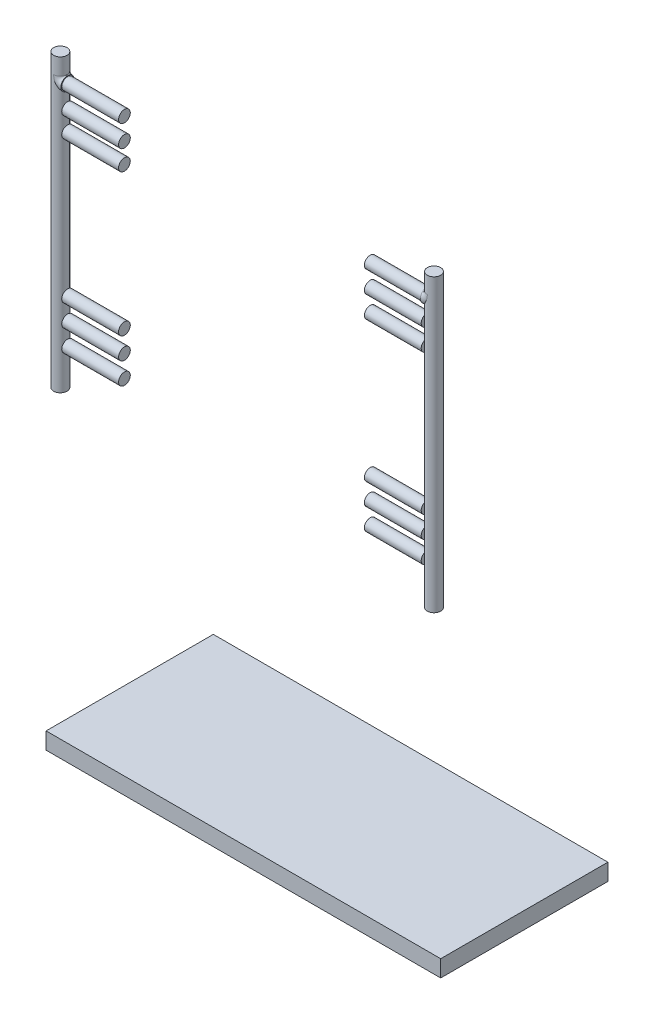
ISO-10303-21;
HEADER;
FILE_DESCRIPTION(('STEP AP214'),'2;1');
FILE_NAME('part.step','',(''),(''),'','','');
FILE_SCHEMA(('AUTOMOTIVE_DESIGN { 1 0 10303 214 1 1 1 1 }'));
ENDSEC;
DATA;
#1=APPLICATION_CONTEXT('core data for automotive mechanical design processes');
#2=APPLICATION_PROTOCOL_DEFINITION('international standard','automotive_design',2000,#1);
#3=PRODUCT_CONTEXT('',#1,'mechanical');
#4=PRODUCT('Part','Part','',(#3));
#5=PRODUCT_RELATED_PRODUCT_CATEGORY('part','',(#4));
#6=PRODUCT_DEFINITION_FORMATION('','',#4);
#7=PRODUCT_DEFINITION_CONTEXT('part definition',#1,'design');
#8=PRODUCT_DEFINITION('design','',#6,#7);
#9=PRODUCT_DEFINITION_SHAPE('','',#8);
#10=(LENGTH_UNIT() NAMED_UNIT(*) SI_UNIT(.MILLI.,.METRE.));
#11=(NAMED_UNIT(*) PLANE_ANGLE_UNIT() SI_UNIT($,.RADIAN.));
#12=(NAMED_UNIT(*) SI_UNIT($,.STERADIAN.) SOLID_ANGLE_UNIT());
#13=UNCERTAINTY_MEASURE_WITH_UNIT(LENGTH_MEASURE(1.E-05),#10,'distance_accuracy_value','');
#14=(GEOMETRIC_REPRESENTATION_CONTEXT(3) GLOBAL_UNCERTAINTY_ASSIGNED_CONTEXT((#13)) GLOBAL_UNIT_ASSIGNED_CONTEXT((#10,
#11,#12)) REPRESENTATION_CONTEXT('',''));
#15=CARTESIAN_POINT('',(0.,0.,0.));
#16=DIRECTION('',(0.,0.,1.));
#17=DIRECTION('',(1.,0.,0.));
#18=AXIS2_PLACEMENT_3D('',#15,#16,#17);
#19=CARTESIAN_POINT('',(945.777768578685,-1629.22223142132,0.));
#20=DIRECTION('',(-1.,0.,0.));
#21=DIRECTION('',(0.,-1.,0.));
#22=AXIS2_PLACEMENT_3D('',#19,#20,#21);
#23=PLANE('',#22);
#24=DIRECTION('',(0.,0.,1.));
#25=VECTOR('',#24,1.);
#26=CARTESIAN_POINT('',(945.777768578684,-1579.22223142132,0.));
#27=LINE('',#26,#25);
#28=CARTESIAN_POINT('',(945.777768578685,-1579.22223142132,-500.));
#29=VERTEX_POINT('',#28);
#30=CARTESIAN_POINT('',(945.777768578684,-1579.22223142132,0.));
#31=VERTEX_POINT('',#30);
#32=EDGE_CURVE('E107',#29,#31,#27,.T.);
#33=ORIENTED_EDGE('',*,*,#32,.T.);
#34=DIRECTION('',(0.,1.,0.));
#35=VECTOR('',#34,1.);
#36=CARTESIAN_POINT('',(945.777768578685,-1629.22223142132,0.));
#37=LINE('',#36,#35);
#38=CARTESIAN_POINT('',(945.777768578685,-1629.22223142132,0.));
#39=VERTEX_POINT('',#38);
#40=EDGE_CURVE('E12',#39,#31,#37,.T.);
#41=ORIENTED_EDGE('',*,*,#40,.F.);
#42=DIRECTION('',(0.,0.,1.));
#43=VECTOR('',#42,1.);
#44=CARTESIAN_POINT('',(945.777768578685,-1629.22223142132,0.));
#45=LINE('',#44,#43);
#46=CARTESIAN_POINT('',(945.777768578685,-1629.22223142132,-500.));
#47=VERTEX_POINT('',#46);
#48=EDGE_CURVE('E95',#47,#39,#45,.T.);
#49=ORIENTED_EDGE('',*,*,#48,.F.);
#50=DIRECTION('',(0.,1.,0.));
#51=VECTOR('',#50,1.);
#52=CARTESIAN_POINT('',(945.777768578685,-1629.22223142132,-500.));
#53=LINE('',#52,#51);
#54=EDGE_CURVE('E103',#47,#29,#53,.T.);
#55=ORIENTED_EDGE('',*,*,#54,.T.);
#56=EDGE_LOOP('',(#33,#41,#49,#55));
#57=FACE_BOUND('',#56,.T.);
#58=ADVANCED_FACE('F44',(#57),#23,.F.);
#59=CARTESIAN_POINT('',(945.777768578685,-1629.22223142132,0.));
#60=DIRECTION('',(0.,0.,-1.));
#61=DIRECTION('',(-1.,0.,0.));
#62=AXIS2_PLACEMENT_3D('',#59,#60,#61);
#63=PLANE('',#62);
#64=DIRECTION('',(-1.,0.,0.));
#65=VECTOR('',#64,1.);
#66=CARTESIAN_POINT('',(945.777768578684,-1579.22223142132,0.));
#67=LINE('',#66,#65);
#68=CARTESIAN_POINT('',(-234.222231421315,-1579.22223142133,-1.43226500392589E-13));
#69=VERTEX_POINT('',#68);
#70=EDGE_CURVE('E99',#31,#69,#67,.T.);
#71=ORIENTED_EDGE('',*,*,#70,.T.);
#72=DIRECTION('',(0.,1.,0.));
#73=VECTOR('',#72,1.);
#74=CARTESIAN_POINT('',(-234.222231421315,-1629.22223142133,-1.43226500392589E-13));
#75=LINE('',#74,#73);
#76=CARTESIAN_POINT('',(-234.222231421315,-1629.22223142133,-1.43226500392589E-13));
#77=VERTEX_POINT('',#76);
#78=EDGE_CURVE('E52',#77,#69,#75,.T.);
#79=ORIENTED_EDGE('',*,*,#78,.F.);
#80=DIRECTION('',(-1.,0.,0.));
#81=VECTOR('',#80,1.);
#82=CARTESIAN_POINT('',(945.777768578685,-1629.22223142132,0.));
#83=LINE('',#82,#81);
#84=EDGE_CURVE('E90',#39,#77,#83,.T.);
#85=ORIENTED_EDGE('',*,*,#84,.F.);
#86=ORIENTED_EDGE('',*,*,#40,.T.);
#87=EDGE_LOOP('',(#71,#79,#85,#86));
#88=FACE_BOUND('',#87,.T.);
#89=ADVANCED_FACE('F98',(#88),#63,.F.);
#90=CARTESIAN_POINT('',(-234.222231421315,-1629.22223142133,-1.43226500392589E-13));
#91=DIRECTION('',(1.,0.,0.));
#92=DIRECTION('',(0.,1.,0.));
#93=AXIS2_PLACEMENT_3D('',#90,#91,#92);
#94=PLANE('',#93);
#95=DIRECTION('',(0.,0.,-1.));
#96=VECTOR('',#95,1.);
#97=CARTESIAN_POINT('',(-234.222231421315,-1579.22223142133,-1.43226500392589E-13));
#98=LINE('',#97,#96);
#99=CARTESIAN_POINT('',(-234.222231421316,-1579.22223142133,-500.));
#100=VERTEX_POINT('',#99);
#101=EDGE_CURVE('E77',#69,#100,#98,.T.);
#102=ORIENTED_EDGE('',*,*,#101,.T.);
#103=DIRECTION('',(0.,1.,0.));
#104=VECTOR('',#103,1.);
#105=CARTESIAN_POINT('',(-234.222231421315,-1629.22223142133,-500.));
#106=LINE('',#105,#104);
#107=CARTESIAN_POINT('',(-234.222231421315,-1629.22223142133,-500.));
#108=VERTEX_POINT('',#107);
#109=EDGE_CURVE('E100',#108,#100,#106,.T.);
#110=ORIENTED_EDGE('',*,*,#109,.F.);
#111=DIRECTION('',(0.,0.,-1.));
#112=VECTOR('',#111,1.);
#113=CARTESIAN_POINT('',(-234.222231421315,-1629.22223142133,-1.43226500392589E-13));
#114=LINE('',#113,#112);
#115=EDGE_CURVE('E93',#77,#108,#114,.T.);
#116=ORIENTED_EDGE('',*,*,#115,.F.);
#117=ORIENTED_EDGE('',*,*,#78,.T.);
#118=EDGE_LOOP('',(#102,#110,#116,#117));
#119=FACE_BOUND('',#118,.T.);
#120=ADVANCED_FACE('F101',(#119),#94,.F.);
#121=CARTESIAN_POINT('',(945.777768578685,-1629.22223142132,-500.));
#122=DIRECTION('',(0.,0.,1.));
#123=DIRECTION('',(1.,0.,0.));
#124=AXIS2_PLACEMENT_3D('',#121,#122,#123);
#125=PLANE('',#124);
#126=DIRECTION('',(1.,0.,0.));
#127=VECTOR('',#126,1.);
#128=CARTESIAN_POINT('',(945.777768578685,-1579.22223142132,-500.));
#129=LINE('',#128,#127);
#130=EDGE_CURVE('E83',#100,#29,#129,.T.);
#131=ORIENTED_EDGE('',*,*,#130,.T.);
#132=ORIENTED_EDGE('',*,*,#54,.F.);
#133=DIRECTION('',(1.,0.,0.));
#134=VECTOR('',#133,1.);
#135=CARTESIAN_POINT('',(945.777768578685,-1629.22223142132,-500.));
#136=LINE('',#135,#134);
#137=EDGE_CURVE('E60',#108,#47,#136,.T.);
#138=ORIENTED_EDGE('',*,*,#137,.F.);
#139=ORIENTED_EDGE('',*,*,#109,.T.);
#140=EDGE_LOOP('',(#131,#132,#138,#139));
#141=FACE_BOUND('',#140,.T.);
#142=ADVANCED_FACE('F114',(#141),#125,.F.);
#143=CARTESIAN_POINT('',(5.68142099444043E-12,-1629.22223142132,0.));
#144=DIRECTION('',(0.,1.,0.));
#145=DIRECTION('',(-1.,0.,0.));
#146=AXIS2_PLACEMENT_3D('',#143,#144,#145);
#147=PLANE('',#146);
#148=ORIENTED_EDGE('',*,*,#48,.T.);
#149=ORIENTED_EDGE('',*,*,#84,.T.);
#150=ORIENTED_EDGE('',*,*,#115,.T.);
#151=ORIENTED_EDGE('',*,*,#137,.T.);
#152=EDGE_LOOP('',(#148,#149,#150,#151));
#153=FACE_BOUND('',#152,.T.);
#154=ADVANCED_FACE('F91',(#153),#147,.F.);
#155=CARTESIAN_POINT('',(5.50684692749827E-12,-1579.22223142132,0.));
#156=DIRECTION('',(0.,1.,0.));
#157=DIRECTION('',(-1.,0.,0.));
#158=AXIS2_PLACEMENT_3D('',#155,#156,#157);
#159=PLANE('',#158);
#160=ORIENTED_EDGE('',*,*,#32,.F.);
#161=ORIENTED_EDGE('',*,*,#130,.F.);
#162=ORIENTED_EDGE('',*,*,#101,.F.);
#163=ORIENTED_EDGE('',*,*,#70,.F.);
#164=EDGE_LOOP('',(#160,#161,#162,#163));
#165=FACE_BOUND('',#164,.T.);
#166=ADVANCED_FACE('F117',(#165),#159,.T.);
#167=CLOSED_SHELL('',(#58,#89,#120,#142,#154,#166));
#168=MANIFOLD_SOLID_BREP('B2',#167);
#169=CARTESIAN_POINT('',(905.,120.,0.));
#170=DIRECTION('',(-1.,0.,0.));
#171=DIRECTION('',(0.,0.,1.));
#172=AXIS2_PLACEMENT_3D('',#169,#170,#171);
#173=CYLINDRICAL_SURFACE('',#172,17.5);
#174=CARTESIAN_POINT('',(905.,120.,0.));
#175=DIRECTION('',(1.,0.,0.));
#176=DIRECTION('',(0.,0.,-1.));
#177=AXIS2_PLACEMENT_3D('',#174,#175,#176);
#178=CIRCLE('',#177,17.5);
#179=CARTESIAN_POINT('',(905.,120.,-17.5));
#180=VERTEX_POINT('',#179);
#181=EDGE_CURVE('E42',#180,#180,#178,.T.);
#182=ORIENTED_EDGE('',*,*,#181,.F.);
#183=EDGE_LOOP('',(#182));
#184=FACE_BOUND('',#183,.T.);
#185=CARTESIAN_POINT('',(735.,120.,0.));
#186=DIRECTION('',(1.,0.,0.));
#187=DIRECTION('',(0.,0.,-1.));
#188=AXIS2_PLACEMENT_3D('',#185,#186,#187);
#189=CIRCLE('',#188,17.5);
#190=CARTESIAN_POINT('',(735.,120.,-17.5));
#191=VERTEX_POINT('',#190);
#192=EDGE_CURVE('E178',#191,#191,#189,.T.);
#193=ORIENTED_EDGE('',*,*,#192,.T.);
#194=EDGE_LOOP('',(#193));
#195=FACE_BOUND('',#194,.T.);
#196=ADVANCED_FACE('F175',(#184,#195),#173,.T.);
#197=CARTESIAN_POINT('',(735.,120.,0.));
#198=DIRECTION('',(1.,0.,0.));
#199=DIRECTION('',(0.,0.,-1.));
#200=AXIS2_PLACEMENT_3D('',#197,#198,#199);
#201=PLANE('',#200);
#202=ORIENTED_EDGE('',*,*,#192,.F.);
#203=EDGE_LOOP('',(#202));
#204=FACE_BOUND('',#203,.T.);
#205=ADVANCED_FACE('F220',(#204),#201,.F.);
#206=CARTESIAN_POINT('',(905.,120.,0.));
#207=DIRECTION('',(1.,0.,0.));
#208=DIRECTION('',(0.,0.,-1.));
#209=AXIS2_PLACEMENT_3D('',#206,#207,#208);
#210=PLANE('',#209);
#211=CARTESIAN_POINT('',(905.,120.,0.));
#212=DIRECTION('',(1.,0.,0.));
#213=DIRECTION('',(0.,0.,-1.));
#214=AXIS2_PLACEMENT_3D('',#211,#212,#213);
#215=CIRCLE('',#214,20.);
#216=CARTESIAN_POINT('',(905.,120.,-20.));
#217=VERTEX_POINT('',#216);
#218=EDGE_CURVE('E194',#217,#217,#215,.T.);
#219=ORIENTED_EDGE('',*,*,#218,.F.);
#220=EDGE_LOOP('',(#219));
#221=FACE_BOUND('',#220,.T.);
#222=ORIENTED_EDGE('',*,*,#181,.T.);
#223=EDGE_LOOP('',(#222));
#224=FACE_BOUND('',#223,.T.);
#225=ADVANCED_FACE('F218',(#221,#224),#210,.F.);
#226=CARTESIAN_POINT('',(905.,140.777768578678,0.));
#227=DIRECTION('',(0.,0.,-1.));
#228=DIRECTION('',(-1.,0.,0.));
#229=AXIS2_PLACEMENT_3D('',#226,#227,#228);
#230=TOROIDAL_SURFACE('',#229,20.7777685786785,20.);
#231=CARTESIAN_POINT('',(925.777768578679,140.777768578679,0.));
#232=DIRECTION('',(0.,1.,0.));
#233=DIRECTION('',(0.,0.,-1.));
#234=AXIS2_PLACEMENT_3D('',#231,#232,#233);
#235=CIRCLE('',#234,20.);
#236=CARTESIAN_POINT('',(925.777768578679,140.777768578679,-20.));
#237=VERTEX_POINT('',#236);
#238=CARTESIAN_POINT('',(925.777768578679,140.777768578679,20.));
#239=VERTEX_POINT('',#238);
#240=EDGE_CURVE('E188',#237,#239,#235,.T.);
#241=ORIENTED_EDGE('',*,*,#240,.F.);
#242=CARTESIAN_POINT('',(925.777768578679,140.777768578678,-20.));
#243=CARTESIAN_POINT('',(925.777768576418,140.709817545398,-20.0000000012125));
#244=CARTESIAN_POINT('',(925.777601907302,140.641866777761,-20.0000000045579));
#245=CARTESIAN_POINT('',(925.776965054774,140.512042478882,-19.9999999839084));
#246=CARTESIAN_POINT('',(925.776523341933,140.450168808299,-19.9999999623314));
#247=CARTESIAN_POINT('',(925.773623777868,140.140796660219,-19.9999997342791));
#248=CARTESIAN_POINT('',(925.769093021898,139.893314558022,-19.9999991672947));
#249=CARTESIAN_POINT('',(925.754061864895,139.341469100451,-19.9999877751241));
#250=CARTESIAN_POINT('',(925.742426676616,139.037136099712,-19.9999746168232));
#251=CARTESIAN_POINT('',(925.714593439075,138.471484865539,-19.9999041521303));
#252=CARTESIAN_POINT('',(925.699264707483,138.210122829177,-19.9998532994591));
#253=CARTESIAN_POINT('',(925.645896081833,137.42616187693,-19.9995979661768));
#254=CARTESIAN_POINT('',(925.600484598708,136.904044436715,-19.9992906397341));
#255=CARTESIAN_POINT('',(925.490253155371,135.861728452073,-19.9980087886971));
#256=CARTESIAN_POINT('',(925.425427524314,135.341530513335,-19.9970340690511));
#257=CARTESIAN_POINT('',(925.275910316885,134.29818200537,-19.9938441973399));
#258=CARTESIAN_POINT('',(925.191009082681,133.775061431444,-19.9916155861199));
#259=CARTESIAN_POINT('',(925.002202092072,132.73226147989,-19.9851785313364));
#260=CARTESIAN_POINT('',(924.898294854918,132.212582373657,-19.9809699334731));
#261=CARTESIAN_POINT('',(924.558764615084,130.659247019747,-19.9641129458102));
#262=CARTESIAN_POINT('',(924.29537327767,129.63157017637,-19.9472333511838));
#263=CARTESIAN_POINT('',(923.69915291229,127.59458345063,-19.8939413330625));
#264=CARTESIAN_POINT('',(923.366160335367,126.585323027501,-19.8574825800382));
#265=CARTESIAN_POINT('',(922.637334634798,124.591399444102,-19.7553288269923));
#266=CARTESIAN_POINT('',(922.241509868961,123.606733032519,-19.6896377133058));
#267=CARTESIAN_POINT('',(921.393454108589,121.664169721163,-19.5183273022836));
#268=CARTESIAN_POINT('',(920.941158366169,120.706305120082,-19.4126618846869));
#269=CARTESIAN_POINT('',(919.988229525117,118.821843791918,-19.1500785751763));
#270=CARTESIAN_POINT('',(919.487588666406,117.895252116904,-18.9931524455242));
#271=CARTESIAN_POINT('',(918.447851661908,116.079177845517,-18.6165931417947));
#272=CARTESIAN_POINT('',(917.908826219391,115.189631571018,-18.397073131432));
#273=CARTESIAN_POINT('',(916.801949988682,113.451140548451,-17.8831422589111));
#274=CARTESIAN_POINT('',(916.234112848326,112.602176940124,-17.5887665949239));
#275=CARTESIAN_POINT('',(915.279745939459,111.234641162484,-17.0289126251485));
#276=CARTESIAN_POINT('',(914.897847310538,110.702641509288,-16.7881672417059));
#277=CARTESIAN_POINT('',(914.131113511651,109.661262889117,-16.265627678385));
#278=CARTESIAN_POINT('',(913.746278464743,109.15188298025,-15.9838352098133));
#279=CARTESIAN_POINT('',(912.978767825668,108.158984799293,-15.3761189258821));
#280=CARTESIAN_POINT('',(912.59609098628,107.675449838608,-15.0502240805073));
#281=CARTESIAN_POINT('',(911.838291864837,106.737429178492,-14.3511872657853));
#282=CARTESIAN_POINT('',(911.463167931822,106.282937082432,-13.9780557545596));
#283=CARTESIAN_POINT('',(910.804488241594,105.499375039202,-13.2658984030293));
#284=CARTESIAN_POINT('',(910.518274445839,105.164037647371,-12.9362180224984));
#285=CARTESIAN_POINT('',(909.958251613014,104.516469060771,-12.2450263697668));
#286=CARTESIAN_POINT('',(909.684442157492,104.204237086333,-11.8835161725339));
#287=CARTESIAN_POINT('',(909.153545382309,103.605917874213,-11.1286968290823));
#288=CARTESIAN_POINT('',(908.896441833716,103.319805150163,-10.735419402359));
#289=CARTESIAN_POINT('',(908.40309429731,102.776431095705,-9.91709603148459));
#290=CARTESIAN_POINT('',(908.166845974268,102.519163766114,-9.49205672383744));
#291=CARTESIAN_POINT('',(907.763422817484,102.083720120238,-8.69721141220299));
#292=CARTESIAN_POINT('',(907.591756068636,101.899898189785,-8.33276858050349));
#293=CARTESIAN_POINT('',(907.267491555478,101.554831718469,-7.58521918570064));
#294=CARTESIAN_POINT('',(907.11488986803,101.393582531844,-7.20211648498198));
#295=CARTESIAN_POINT('',(906.831239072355,101.095421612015,-6.41891187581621));
#296=CARTESIAN_POINT('',(906.700184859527,100.958504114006,-6.01881402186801));
#297=CARTESIAN_POINT('',(906.461925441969,100.710626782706,-5.20369791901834));
#298=CARTESIAN_POINT('',(906.354720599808,100.599667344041,-4.78867944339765));
#299=CARTESIAN_POINT('',(906.16567398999,100.404611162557,-3.94388325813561));
#300=CARTESIAN_POINT('',(906.083991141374,100.320682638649,-3.51403088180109));
#301=CARTESIAN_POINT('',(905.948606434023,100.181859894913,-2.64529106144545));
#302=CARTESIAN_POINT('',(905.89490479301,100.126965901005,-2.20640354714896));
#303=CARTESIAN_POINT('',(905.816686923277,100.047085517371,-1.32347063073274));
#304=CARTESIAN_POINT('',(905.79216107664,100.02208927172,-0.879426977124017));
#305=CARTESIAN_POINT('',(905.772826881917,100.002380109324,0.00995887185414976));
#306=CARTESIAN_POINT('',(905.778015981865,100.007664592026,0.45530095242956));
#307=CARTESIAN_POINT('',(905.815961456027,100.04636134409,1.29847540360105));
#308=CARTESIAN_POINT('',(905.845887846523,100.076886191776,1.69657403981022));
#309=CARTESIAN_POINT('',(905.929103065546,100.161937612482,2.48769894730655));
#310=CARTESIAN_POINT('',(905.982389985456,100.216462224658,2.88072563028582));
#311=CARTESIAN_POINT('',(906.111376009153,100.348826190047,3.65904628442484));
#312=CARTESIAN_POINT('',(906.187073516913,100.426663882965,4.04434080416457));
#313=CARTESIAN_POINT('',(906.359602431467,100.604735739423,4.80488216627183));
#314=CARTESIAN_POINT('',(906.456434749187,100.704970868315,5.18012857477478));
#315=CARTESIAN_POINT('',(906.67138204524,100.928490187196,5.92439055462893));
#316=CARTESIAN_POINT('',(906.789809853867,101.052114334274,6.29321326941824));
#317=CARTESIAN_POINT('',(907.045076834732,101.320043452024,7.01665255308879));
#318=CARTESIAN_POINT('',(907.181915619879,101.464347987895,7.37126942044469));
#319=CARTESIAN_POINT('',(907.472142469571,101.772333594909,8.06507867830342));
#320=CARTESIAN_POINT('',(907.625535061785,101.936019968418,8.4042668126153));
#321=CARTESIAN_POINT('',(907.94691202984,102.281385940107,9.06620053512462));
#322=CARTESIAN_POINT('',(908.114899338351,102.463069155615,9.38894279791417));
#323=CARTESIAN_POINT('',(908.538533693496,102.924828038,10.1524731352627));
#324=CARTESIAN_POINT('',(908.800815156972,103.21362084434,10.5843503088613));
#325=CARTESIAN_POINT('',(909.345925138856,103.82157011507,11.4122924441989));
#326=CARTESIAN_POINT('',(909.628760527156,104.140736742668,11.8083453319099));
#327=CARTESIAN_POINT('',(910.210422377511,104.806532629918,12.5652648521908));
#328=CARTESIAN_POINT('',(910.509272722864,105.153203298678,12.9260765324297));
#329=CARTESIAN_POINT('',(911.11804754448,105.870550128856,13.612609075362));
#330=CARTESIAN_POINT('',(911.427972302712,106.241226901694,13.9383290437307));
#331=CARTESIAN_POINT('',(912.181000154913,107.157422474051,14.6802108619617));
#332=CARTESIAN_POINT('',(912.627556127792,107.713325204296,15.0800930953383));
#333=CARTESIAN_POINT('',(913.525155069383,108.861350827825,15.8180692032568));
#334=CARTESIAN_POINT('',(913.976199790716,109.453488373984,16.1561378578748));
#335=CARTESIAN_POINT('',(914.875373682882,110.669959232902,16.7760657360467));
#336=CARTESIAN_POINT('',(915.32349774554,111.294337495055,17.0578436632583));
#337=CARTESIAN_POINT('',(916.209401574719,112.570594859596,17.5700926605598));
#338=CARTESIAN_POINT('',(916.647181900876,113.222472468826,17.8005665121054));
#339=CARTESIAN_POINT('',(917.630701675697,114.742345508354,18.275764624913));
#340=CARTESIAN_POINT('',(918.171176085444,115.618462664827,18.5054387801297));
#341=CARTESIAN_POINT('',(919.215247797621,117.40646092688,18.9009273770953));
#342=CARTESIAN_POINT('',(919.718832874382,118.318353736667,19.0667207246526));
#343=CARTESIAN_POINT('',(920.679816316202,120.173023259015,19.3458273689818));
#344=CARTESIAN_POINT('',(921.137247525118,121.11577736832,19.4591781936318));
#345=CARTESIAN_POINT('',(921.998431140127,123.028972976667,19.6446065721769));
#346=CARTESIAN_POINT('',(922.402201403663,123.999405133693,19.7166978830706));
#347=CARTESIAN_POINT('',(923.152390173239,125.973064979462,19.8305986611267));
#348=CARTESIAN_POINT('',(923.498317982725,126.976494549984,19.8721582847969));
#349=CARTESIAN_POINT('',(923.966255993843,128.497143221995,19.9184045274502));
#350=CARTESIAN_POINT('',(924.113699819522,129.006426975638,19.9311360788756));
#351=CARTESIAN_POINT('',(924.390999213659,130.029854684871,19.9523490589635));
#352=CARTESIAN_POINT('',(924.520855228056,130.543998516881,19.9608305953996));
#353=CARTESIAN_POINT('',(924.789821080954,131.694204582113,19.9761369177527));
#354=CARTESIAN_POINT('',(924.924303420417,132.331366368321,19.9821445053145));
#355=CARTESIAN_POINT('',(925.164699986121,133.611022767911,19.9909624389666));
#356=CARTESIAN_POINT('',(925.270615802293,134.253517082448,19.9937729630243));
#357=CARTESIAN_POINT('',(925.475695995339,135.703024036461,19.9980480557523));
#358=CARTESIAN_POINT('',(925.566635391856,136.511226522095,19.9990042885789));
#359=CARTESIAN_POINT('',(925.675193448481,137.816290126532,19.9997761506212));
#360=CARTESIAN_POINT('',(925.707572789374,138.311970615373,19.9998907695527));
#361=CARTESIAN_POINT('',(925.744971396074,139.100983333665,19.9999778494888));
#362=CARTESIAN_POINT('',(925.755764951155,139.394047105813,19.9999893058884));
#363=CARTESIAN_POINT('',(925.771213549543,139.982709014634,20.0000004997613));
#364=CARTESIAN_POINT('',(925.775818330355,140.278308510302,20.0000001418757));
#365=CARTESIAN_POINT('',(925.77760194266,140.641867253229,19.9999999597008));
#366=CARTESIAN_POINT('',(925.777768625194,140.7098181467,19.9999999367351));
#367=CARTESIAN_POINT('',(925.777768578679,140.777768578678,20.));
#368=B_SPLINE_CURVE_WITH_KNOTS('',3,(#242,#243,#244,#245,#246,#247,#248,#249,#250,#251,#252,
#253,#254,#255,#256,#257,#258,#259,#260,#261,#262,#263,#264,#265,#266,#267,#268,#269,#270,#271,
#272,#273,#274,#275,#276,#277,#278,#279,#280,#281,#282,#283,#284,#285,#286,#287,#288,#289,#290,
#291,#292,#293,#294,#295,#296,#297,#298,#299,#300,#301,#302,#303,#304,#305,#306,#307,#308,#309,
#310,#311,#312,#313,#314,#315,#316,#317,#318,#319,#320,#321,#322,#323,#324,#325,#326,#327,#328,
#329,#330,#331,#332,#333,#334,#335,#336,#337,#338,#339,#340,#341,#342,#343,#344,#345,#346,#347,
#348,#349,#350,#351,#352,#353,#354,#355,#356,#357,#358,#359,#360,#361,#362,#363,#364,#365,#366,
#367),.UNSPECIFIED.,.F.,.F.,(4,2,2,2,2,2,2,2,2,2,2,2,2,2,2,2,2,2,2,2,2,2,2,2,2,2,2,2,2,2,2,2,2,
2,2,2,2,2,2,2,2,2,2,2,2,2,2,2,2,2,2,2,2,2,2,2,2,2,2,2,2,2,4),(0.,0.203852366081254,
0.389477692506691,1.13200675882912,2.04559394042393,2.8309908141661,4.40285333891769,
5.97517545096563,7.56470583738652,9.15436011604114,12.3345076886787,15.5222137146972,
18.7094960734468,21.9004670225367,25.0919510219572,28.277701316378,31.4619563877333,
33.5537964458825,35.6455493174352,37.7359347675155,39.8258582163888,41.4760031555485,
43.1260923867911,44.7745539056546,46.4226719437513,47.7498316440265,49.0767177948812,
50.403289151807,51.7298806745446,53.0645751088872,54.3992799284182,55.73354463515,
57.0676947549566,58.2674335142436,59.4670742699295,60.6666296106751,61.8662366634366,
63.0848460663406,64.3034298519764,65.5223477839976,66.7415112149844,68.4848809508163,
70.228836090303,71.9754685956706,73.7221456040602,76.1709827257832,78.6208167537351,
81.0741637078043,83.527377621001,86.6878992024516,89.8494635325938,93.0087619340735,
96.1670063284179,99.3508154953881,100.941593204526,102.532330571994,104.48533981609,
106.438240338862,108.876657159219,110.366572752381,111.246299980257,112.133129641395,
112.336982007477),.UNSPECIFIED.);
#369=EDGE_CURVE('E190',#237,#239,#368,.T.);
#370=ORIENTED_EDGE('',*,*,#369,.T.);
#371=EDGE_LOOP('',(#241,#370));
#372=FACE_BOUND('',#371,.T.);
#373=ORIENTED_EDGE('',*,*,#218,.T.);
#374=EDGE_LOOP('',(#373));
#375=FACE_BOUND('',#374,.T.);
#376=ADVANCED_FACE('F191',(#372,#375),#230,.T.);
#377=CARTESIAN_POINT('',(925.777768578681,-679.222231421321,0.));
#378=DIRECTION('',(0.,1.,0.));
#379=DIRECTION('',(-1.,0.,0.));
#380=AXIS2_PLACEMENT_3D('',#377,#378,#379);
#381=CYLINDRICAL_SURFACE('',#380,20.);
#382=CARTESIAN_POINT('',(925.777768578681,-679.222231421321,0.));
#383=DIRECTION('',(0.,1.,0.));
#384=DIRECTION('',(-1.,0.,0.));
#385=AXIS2_PLACEMENT_3D('',#382,#383,#384);
#386=CIRCLE('',#385,20.);
#387=CARTESIAN_POINT('',(905.777768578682,-679.222231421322,0.));
#388=VERTEX_POINT('',#387);
#389=EDGE_CURVE('E195',#388,#388,#386,.T.);
#390=ORIENTED_EDGE('',*,*,#389,.T.);
#391=EDGE_LOOP('',(#390));
#392=FACE_BOUND('',#391,.T.);
#393=ORIENTED_EDGE('',*,*,#369,.F.);
#394=ORIENTED_EDGE('',*,*,#240,.T.);
#395=EDGE_LOOP('',(#393,#394));
#396=FACE_BOUND('',#395,.T.);
#397=CARTESIAN_POINT('',(925.777768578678,190.777768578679,0.));
#398=DIRECTION('',(0.,1.,0.));
#399=DIRECTION('',(-1.,0.,0.));
#400=AXIS2_PLACEMENT_3D('',#397,#398,#399);
#401=CIRCLE('',#400,20.);
#402=CARTESIAN_POINT('',(905.777768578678,190.777768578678,0.));
#403=VERTEX_POINT('',#402);
#404=EDGE_CURVE('E279',#403,#403,#401,.T.);
#405=ORIENTED_EDGE('',*,*,#404,.F.);
#406=EDGE_LOOP('',(#405));
#407=FACE_BOUND('',#406,.T.);
#408=ADVANCED_FACE('F197',(#392,#396,#407),#381,.T.);
#409=CARTESIAN_POINT('',(925.777768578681,-679.222231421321,0.));
#410=DIRECTION('',(0.,1.,0.));
#411=DIRECTION('',(-1.,0.,0.));
#412=AXIS2_PLACEMENT_3D('',#409,#410,#411);
#413=PLANE('',#412);
#414=ORIENTED_EDGE('',*,*,#389,.F.);
#415=EDGE_LOOP('',(#414));
#416=FACE_BOUND('',#415,.T.);
#417=ADVANCED_FACE('F215',(#416),#413,.F.);
#418=CARTESIAN_POINT('',(925.777768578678,190.777768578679,0.));
#419=DIRECTION('',(0.,1.,0.));
#420=DIRECTION('',(-1.,0.,0.));
#421=AXIS2_PLACEMENT_3D('',#418,#419,#420);
#422=PLANE('',#421);
#423=ORIENTED_EDGE('',*,*,#404,.T.);
#424=EDGE_LOOP('',(#423));
#425=FACE_BOUND('',#424,.T.);
#426=ADVANCED_FACE('F265',(#425),#422,.T.);
#427=CLOSED_SHELL('',(#196,#205,#225,#376,#408,#417,#426));
#428=MANIFOLD_SOLID_BREP('B6',#427);
#429=CARTESIAN_POINT('',(905.,55.0000000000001,0.));
#430=DIRECTION('',(-1.,0.,0.));
#431=DIRECTION('',(0.,0.,1.));
#432=AXIS2_PLACEMENT_3D('',#429,#430,#431);
#433=CYLINDRICAL_SURFACE('',#432,17.5);
#434=CARTESIAN_POINT('',(905.,55.0000000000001,0.));
#435=DIRECTION('',(1.,0.,0.));
#436=DIRECTION('',(0.,0.,-1.));
#437=AXIS2_PLACEMENT_3D('',#434,#435,#436);
#438=CIRCLE('',#437,17.5);
#439=CARTESIAN_POINT('',(905.,55.0000000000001,-17.5));
#440=VERTEX_POINT('',#439);
#441=EDGE_CURVE('E174',#440,#440,#438,.T.);
#442=ORIENTED_EDGE('',*,*,#441,.F.);
#443=EDGE_LOOP('',(#442));
#444=FACE_BOUND('',#443,.T.);
#445=CARTESIAN_POINT('',(735.,55.0000000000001,0.));
#446=DIRECTION('',(1.,0.,0.));
#447=DIRECTION('',(0.,0.,-1.));
#448=AXIS2_PLACEMENT_3D('',#445,#446,#447);
#449=CIRCLE('',#448,17.5);
#450=CARTESIAN_POINT('',(735.,55.0000000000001,-17.5));
#451=VERTEX_POINT('',#450);
#452=EDGE_CURVE('E297',#451,#451,#449,.T.);
#453=ORIENTED_EDGE('',*,*,#452,.T.);
#454=EDGE_LOOP('',(#453));
#455=FACE_BOUND('',#454,.T.);
#456=ADVANCED_FACE('F294',(#444,#455),#433,.T.);
#457=CARTESIAN_POINT('',(905.,55.0000000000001,0.));
#458=DIRECTION('',(1.,0.,0.));
#459=DIRECTION('',(0.,0.,-1.));
#460=AXIS2_PLACEMENT_3D('',#457,#458,#459);
#461=PLANE('',#460);
#462=ORIENTED_EDGE('',*,*,#441,.T.);
#463=EDGE_LOOP('',(#462));
#464=FACE_BOUND('',#463,.T.);
#465=ADVANCED_FACE('F309',(#464),#461,.T.);
#466=CARTESIAN_POINT('',(735.,55.0000000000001,0.));
#467=DIRECTION('',(1.,0.,0.));
#468=DIRECTION('',(0.,0.,-1.));
#469=AXIS2_PLACEMENT_3D('',#466,#467,#468);
#470=PLANE('',#469);
#471=ORIENTED_EDGE('',*,*,#452,.F.);
#472=EDGE_LOOP('',(#471));
#473=FACE_BOUND('',#472,.T.);
#474=ADVANCED_FACE('F307',(#473),#470,.F.);
#475=CLOSED_SHELL('',(#456,#465,#474));
#476=MANIFOLD_SOLID_BREP('B36',#475);
#477=CARTESIAN_POINT('',(905.,-9.99999999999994,0.));
#478=DIRECTION('',(-1.,0.,0.));
#479=DIRECTION('',(0.,0.,1.));
#480=AXIS2_PLACEMENT_3D('',#477,#478,#479);
#481=CYLINDRICAL_SURFACE('',#480,17.5);
#482=CARTESIAN_POINT('',(905.,-9.99999999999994,0.));
#483=DIRECTION('',(1.,0.,0.));
#484=DIRECTION('',(0.,0.,-1.));
#485=AXIS2_PLACEMENT_3D('',#482,#483,#484);
#486=CIRCLE('',#485,17.5);
#487=CARTESIAN_POINT('',(905.,-9.99999999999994,-17.5));
#488=VERTEX_POINT('',#487);
#489=EDGE_CURVE('E293',#488,#488,#486,.T.);
#490=ORIENTED_EDGE('',*,*,#489,.F.);
#491=EDGE_LOOP('',(#490));
#492=FACE_BOUND('',#491,.T.);
#493=CARTESIAN_POINT('',(735.,-9.99999999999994,0.));
#494=DIRECTION('',(1.,0.,0.));
#495=DIRECTION('',(0.,0.,-1.));
#496=AXIS2_PLACEMENT_3D('',#493,#494,#495);
#497=CIRCLE('',#496,17.5);
#498=CARTESIAN_POINT('',(735.,-9.99999999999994,-17.5));
#499=VERTEX_POINT('',#498);
#500=EDGE_CURVE('E345',#499,#499,#497,.T.);
#501=ORIENTED_EDGE('',*,*,#500,.T.);
#502=EDGE_LOOP('',(#501));
#503=FACE_BOUND('',#502,.T.);
#504=ADVANCED_FACE('F342',(#492,#503),#481,.T.);
#505=CARTESIAN_POINT('',(905.,-9.99999999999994,0.));
#506=DIRECTION('',(1.,0.,0.));
#507=DIRECTION('',(0.,0.,-1.));
#508=AXIS2_PLACEMENT_3D('',#505,#506,#507);
#509=PLANE('',#508);
#510=ORIENTED_EDGE('',*,*,#489,.T.);
#511=EDGE_LOOP('',(#510));
#512=FACE_BOUND('',#511,.T.);
#513=ADVANCED_FACE('F357',(#512),#509,.T.);
#514=CARTESIAN_POINT('',(735.,-9.99999999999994,0.));
#515=DIRECTION('',(1.,0.,0.));
#516=DIRECTION('',(0.,0.,-1.));
#517=AXIS2_PLACEMENT_3D('',#514,#515,#516);
#518=PLANE('',#517);
#519=ORIENTED_EDGE('',*,*,#500,.F.);
#520=EDGE_LOOP('',(#519));
#521=FACE_BOUND('',#520,.T.);
#522=ADVANCED_FACE('F355',(#521),#518,.F.);
#523=CLOSED_SHELL('',(#504,#513,#522));
#524=MANIFOLD_SOLID_BREP('B169',#523);
#525=CARTESIAN_POINT('',(905.,-430.,0.));
#526=DIRECTION('',(-1.,0.,0.));
#527=DIRECTION('',(0.,0.,1.));
#528=AXIS2_PLACEMENT_3D('',#525,#526,#527);
#529=CYLINDRICAL_SURFACE('',#528,17.5);
#530=CARTESIAN_POINT('',(905.,-430.,0.));
#531=DIRECTION('',(1.,0.,0.));
#532=DIRECTION('',(0.,0.,-1.));
#533=AXIS2_PLACEMENT_3D('',#530,#531,#532);
#534=CIRCLE('',#533,17.5);
#535=CARTESIAN_POINT('',(905.,-430.,-17.5));
#536=VERTEX_POINT('',#535);
#537=EDGE_CURVE('E341',#536,#536,#534,.T.);
#538=ORIENTED_EDGE('',*,*,#537,.F.);
#539=EDGE_LOOP('',(#538));
#540=FACE_BOUND('',#539,.T.);
#541=CARTESIAN_POINT('',(735.,-430.,0.));
#542=DIRECTION('',(1.,0.,0.));
#543=DIRECTION('',(0.,0.,-1.));
#544=AXIS2_PLACEMENT_3D('',#541,#542,#543);
#545=CIRCLE('',#544,17.5);
#546=CARTESIAN_POINT('',(735.,-430.,-17.5));
#547=VERTEX_POINT('',#546);
#548=EDGE_CURVE('E393',#547,#547,#545,.T.);
#549=ORIENTED_EDGE('',*,*,#548,.T.);
#550=EDGE_LOOP('',(#549));
#551=FACE_BOUND('',#550,.T.);
#552=ADVANCED_FACE('F390',(#540,#551),#529,.T.);
#553=CARTESIAN_POINT('',(905.,-430.,0.));
#554=DIRECTION('',(1.,0.,0.));
#555=DIRECTION('',(0.,0.,-1.));
#556=AXIS2_PLACEMENT_3D('',#553,#554,#555);
#557=PLANE('',#556);
#558=ORIENTED_EDGE('',*,*,#537,.T.);
#559=EDGE_LOOP('',(#558));
#560=FACE_BOUND('',#559,.T.);
#561=ADVANCED_FACE('F405',(#560),#557,.T.);
#562=CARTESIAN_POINT('',(735.,-430.,0.));
#563=DIRECTION('',(1.,0.,0.));
#564=DIRECTION('',(0.,0.,-1.));
#565=AXIS2_PLACEMENT_3D('',#562,#563,#564);
#566=PLANE('',#565);
#567=ORIENTED_EDGE('',*,*,#548,.F.);
#568=EDGE_LOOP('',(#567));
#569=FACE_BOUND('',#568,.T.);
#570=ADVANCED_FACE('F403',(#569),#566,.F.);
#571=CLOSED_SHELL('',(#552,#561,#570));
#572=MANIFOLD_SOLID_BREP('B288',#571);
#573=CARTESIAN_POINT('',(905.,-495.,0.));
#574=DIRECTION('',(-1.,0.,0.));
#575=DIRECTION('',(0.,0.,1.));
#576=AXIS2_PLACEMENT_3D('',#573,#574,#575);
#577=CYLINDRICAL_SURFACE('',#576,17.5);
#578=CARTESIAN_POINT('',(905.,-495.,0.));
#579=DIRECTION('',(1.,0.,0.));
#580=DIRECTION('',(0.,0.,-1.));
#581=AXIS2_PLACEMENT_3D('',#578,#579,#580);
#582=CIRCLE('',#581,17.5);
#583=CARTESIAN_POINT('',(905.,-495.,-17.5));
#584=VERTEX_POINT('',#583);
#585=EDGE_CURVE('E389',#584,#584,#582,.T.);
#586=ORIENTED_EDGE('',*,*,#585,.F.);
#587=EDGE_LOOP('',(#586));
#588=FACE_BOUND('',#587,.T.);
#589=CARTESIAN_POINT('',(735.,-495.,0.));
#590=DIRECTION('',(1.,0.,0.));
#591=DIRECTION('',(0.,0.,-1.));
#592=AXIS2_PLACEMENT_3D('',#589,#590,#591);
#593=CIRCLE('',#592,17.5);
#594=CARTESIAN_POINT('',(735.,-495.,-17.5));
#595=VERTEX_POINT('',#594);
#596=EDGE_CURVE('E441',#595,#595,#593,.T.);
#597=ORIENTED_EDGE('',*,*,#596,.T.);
#598=EDGE_LOOP('',(#597));
#599=FACE_BOUND('',#598,.T.);
#600=ADVANCED_FACE('F438',(#588,#599),#577,.T.);
#601=CARTESIAN_POINT('',(905.,-495.,0.));
#602=DIRECTION('',(1.,0.,0.));
#603=DIRECTION('',(0.,0.,-1.));
#604=AXIS2_PLACEMENT_3D('',#601,#602,#603);
#605=PLANE('',#604);
#606=ORIENTED_EDGE('',*,*,#585,.T.);
#607=EDGE_LOOP('',(#606));
#608=FACE_BOUND('',#607,.T.);
#609=ADVANCED_FACE('F453',(#608),#605,.T.);
#610=CARTESIAN_POINT('',(735.,-495.,0.));
#611=DIRECTION('',(1.,0.,0.));
#612=DIRECTION('',(0.,0.,-1.));
#613=AXIS2_PLACEMENT_3D('',#610,#611,#612);
#614=PLANE('',#613);
#615=ORIENTED_EDGE('',*,*,#596,.F.);
#616=EDGE_LOOP('',(#615));
#617=FACE_BOUND('',#616,.T.);
#618=ADVANCED_FACE('F451',(#617),#614,.F.);
#619=CLOSED_SHELL('',(#600,#609,#618));
#620=MANIFOLD_SOLID_BREP('B336',#619);
#621=CARTESIAN_POINT('',(905.,-560.,0.));
#622=DIRECTION('',(-1.,0.,0.));
#623=DIRECTION('',(0.,0.,1.));
#624=AXIS2_PLACEMENT_3D('',#621,#622,#623);
#625=CYLINDRICAL_SURFACE('',#624,17.5);
#626=CARTESIAN_POINT('',(905.,-560.,0.));
#627=DIRECTION('',(1.,0.,0.));
#628=DIRECTION('',(0.,0.,-1.));
#629=AXIS2_PLACEMENT_3D('',#626,#627,#628);
#630=CIRCLE('',#629,17.5);
#631=CARTESIAN_POINT('',(905.,-560.,-17.5));
#632=VERTEX_POINT('',#631);
#633=EDGE_CURVE('E437',#632,#632,#630,.T.);
#634=ORIENTED_EDGE('',*,*,#633,.F.);
#635=EDGE_LOOP('',(#634));
#636=FACE_BOUND('',#635,.T.);
#637=CARTESIAN_POINT('',(735.,-560.,0.));
#638=DIRECTION('',(1.,0.,0.));
#639=DIRECTION('',(0.,0.,-1.));
#640=AXIS2_PLACEMENT_3D('',#637,#638,#639);
#641=CIRCLE('',#640,17.5);
#642=CARTESIAN_POINT('',(735.,-560.,-17.5));
#643=VERTEX_POINT('',#642);
#644=EDGE_CURVE('E489',#643,#643,#641,.T.);
#645=ORIENTED_EDGE('',*,*,#644,.T.);
#646=EDGE_LOOP('',(#645));
#647=FACE_BOUND('',#646,.T.);
#648=ADVANCED_FACE('F486',(#636,#647),#625,.T.);
#649=CARTESIAN_POINT('',(905.,-560.,0.));
#650=DIRECTION('',(1.,0.,0.));
#651=DIRECTION('',(0.,0.,-1.));
#652=AXIS2_PLACEMENT_3D('',#649,#650,#651);
#653=PLANE('',#652);
#654=ORIENTED_EDGE('',*,*,#633,.T.);
#655=EDGE_LOOP('',(#654));
#656=FACE_BOUND('',#655,.T.);
#657=ADVANCED_FACE('F501',(#656),#653,.T.);
#658=CARTESIAN_POINT('',(735.,-560.,0.));
#659=DIRECTION('',(1.,0.,0.));
#660=DIRECTION('',(0.,0.,-1.));
#661=AXIS2_PLACEMENT_3D('',#658,#659,#660);
#662=PLANE('',#661);
#663=ORIENTED_EDGE('',*,*,#644,.F.);
#664=EDGE_LOOP('',(#663));
#665=FACE_BOUND('',#664,.T.);
#666=ADVANCED_FACE('F499',(#665),#662,.F.);
#667=CLOSED_SHELL('',(#648,#657,#666));
#668=MANIFOLD_SOLID_BREP('B384',#667);
#669=CARTESIAN_POINT('',(-170.,-550.,0.));
#670=DIRECTION('',(1.,0.,0.));
#671=DIRECTION('',(0.,0.,-1.));
#672=AXIS2_PLACEMENT_3D('',#669,#670,#671);
#673=CYLINDRICAL_SURFACE('',#672,17.5);
#674=CARTESIAN_POINT('',(-170.,-550.,0.));
#675=DIRECTION('',(1.,0.,0.));
#676=DIRECTION('',(0.,0.,-1.));
#677=AXIS2_PLACEMENT_3D('',#674,#675,#676);
#678=CIRCLE('',#677,17.5);
#679=CARTESIAN_POINT('',(-170.,-550.,-17.5));
#680=VERTEX_POINT('',#679);
#681=EDGE_CURVE('E485',#680,#680,#678,.T.);
#682=ORIENTED_EDGE('',*,*,#681,.T.);
#683=EDGE_LOOP('',(#682));
#684=FACE_BOUND('',#683,.T.);
#685=CARTESIAN_POINT('',(0.,-550.,0.));
#686=DIRECTION('',(1.,0.,0.));
#687=DIRECTION('',(0.,0.,-1.));
#688=AXIS2_PLACEMENT_3D('',#685,#686,#687);
#689=CIRCLE('',#688,17.5);
#690=CARTESIAN_POINT('',(0.,-550.,-17.5));
#691=VERTEX_POINT('',#690);
#692=EDGE_CURVE('E537',#691,#691,#689,.T.);
#693=ORIENTED_EDGE('',*,*,#692,.F.);
#694=EDGE_LOOP('',(#693));
#695=FACE_BOUND('',#694,.T.);
#696=ADVANCED_FACE('F534',(#684,#695),#673,.T.);
#697=CARTESIAN_POINT('',(-170.,-550.,0.));
#698=DIRECTION('',(1.,0.,0.));
#699=DIRECTION('',(0.,0.,-1.));
#700=AXIS2_PLACEMENT_3D('',#697,#698,#699);
#701=PLANE('',#700);
#702=ORIENTED_EDGE('',*,*,#681,.F.);
#703=EDGE_LOOP('',(#702));
#704=FACE_BOUND('',#703,.T.);
#705=ADVANCED_FACE('F549',(#704),#701,.F.);
#706=CARTESIAN_POINT('',(0.,-550.,0.));
#707=DIRECTION('',(1.,0.,0.));
#708=DIRECTION('',(0.,0.,-1.));
#709=AXIS2_PLACEMENT_3D('',#706,#707,#708);
#710=PLANE('',#709);
#711=ORIENTED_EDGE('',*,*,#692,.T.);
#712=EDGE_LOOP('',(#711));
#713=FACE_BOUND('',#712,.T.);
#714=ADVANCED_FACE('F546',(#713),#710,.T.);
#715=CLOSED_SHELL('',(#696,#705,#714));
#716=MANIFOLD_SOLID_BREP('B432',#715);
#717=CARTESIAN_POINT('',(-170.,-485.,0.));
#718=DIRECTION('',(1.,0.,0.));
#719=DIRECTION('',(0.,0.,-1.));
#720=AXIS2_PLACEMENT_3D('',#717,#718,#719);
#721=CYLINDRICAL_SURFACE('',#720,17.5);
#722=CARTESIAN_POINT('',(-170.,-485.,0.));
#723=DIRECTION('',(1.,0.,0.));
#724=DIRECTION('',(0.,0.,-1.));
#725=AXIS2_PLACEMENT_3D('',#722,#723,#724);
#726=CIRCLE('',#725,17.5);
#727=CARTESIAN_POINT('',(-170.,-485.,-17.5));
#728=VERTEX_POINT('',#727);
#729=EDGE_CURVE('E533',#728,#728,#726,.T.);
#730=ORIENTED_EDGE('',*,*,#729,.T.);
#731=EDGE_LOOP('',(#730));
#732=FACE_BOUND('',#731,.T.);
#733=CARTESIAN_POINT('',(0.,-485.,0.));
#734=DIRECTION('',(1.,0.,0.));
#735=DIRECTION('',(0.,0.,-1.));
#736=AXIS2_PLACEMENT_3D('',#733,#734,#735);
#737=CIRCLE('',#736,17.5);
#738=CARTESIAN_POINT('',(0.,-485.,-17.5));
#739=VERTEX_POINT('',#738);
#740=EDGE_CURVE('E585',#739,#739,#737,.T.);
#741=ORIENTED_EDGE('',*,*,#740,.F.);
#742=EDGE_LOOP('',(#741));
#743=FACE_BOUND('',#742,.T.);
#744=ADVANCED_FACE('F582',(#732,#743),#721,.T.);
#745=CARTESIAN_POINT('',(-170.,-485.,0.));
#746=DIRECTION('',(1.,0.,0.));
#747=DIRECTION('',(0.,0.,-1.));
#748=AXIS2_PLACEMENT_3D('',#745,#746,#747);
#749=PLANE('',#748);
#750=ORIENTED_EDGE('',*,*,#729,.F.);
#751=EDGE_LOOP('',(#750));
#752=FACE_BOUND('',#751,.T.);
#753=ADVANCED_FACE('F597',(#752),#749,.F.);
#754=CARTESIAN_POINT('',(0.,-485.,0.));
#755=DIRECTION('',(1.,0.,0.));
#756=DIRECTION('',(0.,0.,-1.));
#757=AXIS2_PLACEMENT_3D('',#754,#755,#756);
#758=PLANE('',#757);
#759=ORIENTED_EDGE('',*,*,#740,.T.);
#760=EDGE_LOOP('',(#759));
#761=FACE_BOUND('',#760,.T.);
#762=ADVANCED_FACE('F594',(#761),#758,.T.);
#763=CLOSED_SHELL('',(#744,#753,#762));
#764=MANIFOLD_SOLID_BREP('B480',#763);
#765=CARTESIAN_POINT('',(-170.,-420.,0.));
#766=DIRECTION('',(1.,0.,0.));
#767=DIRECTION('',(0.,0.,-1.));
#768=AXIS2_PLACEMENT_3D('',#765,#766,#767);
#769=CYLINDRICAL_SURFACE('',#768,17.5);
#770=CARTESIAN_POINT('',(-170.,-420.,0.));
#771=DIRECTION('',(1.,0.,0.));
#772=DIRECTION('',(0.,0.,-1.));
#773=AXIS2_PLACEMENT_3D('',#770,#771,#772);
#774=CIRCLE('',#773,17.5);
#775=CARTESIAN_POINT('',(-170.,-420.,-17.5));
#776=VERTEX_POINT('',#775);
#777=EDGE_CURVE('E581',#776,#776,#774,.T.);
#778=ORIENTED_EDGE('',*,*,#777,.T.);
#779=EDGE_LOOP('',(#778));
#780=FACE_BOUND('',#779,.T.);
#781=CARTESIAN_POINT('',(0.,-420.,0.));
#782=DIRECTION('',(1.,0.,0.));
#783=DIRECTION('',(0.,0.,-1.));
#784=AXIS2_PLACEMENT_3D('',#781,#782,#783);
#785=CIRCLE('',#784,17.5);
#786=CARTESIAN_POINT('',(0.,-420.,-17.5));
#787=VERTEX_POINT('',#786);
#788=EDGE_CURVE('E635',#787,#787,#785,.T.);
#789=ORIENTED_EDGE('',*,*,#788,.F.);
#790=EDGE_LOOP('',(#789));
#791=FACE_BOUND('',#790,.T.);
#792=ADVANCED_FACE('F632',(#780,#791),#769,.T.);
#793=CARTESIAN_POINT('',(-170.,-420.,0.));
#794=DIRECTION('',(1.,0.,0.));
#795=DIRECTION('',(0.,0.,-1.));
#796=AXIS2_PLACEMENT_3D('',#793,#794,#795);
#797=PLANE('',#796);
#798=ORIENTED_EDGE('',*,*,#777,.F.);
#799=EDGE_LOOP('',(#798));
#800=FACE_BOUND('',#799,.T.);
#801=ADVANCED_FACE('F647',(#800),#797,.F.);
#802=CARTESIAN_POINT('',(0.,-420.,0.));
#803=DIRECTION('',(1.,0.,0.));
#804=DIRECTION('',(0.,0.,-1.));
#805=AXIS2_PLACEMENT_3D('',#802,#803,#804);
#806=PLANE('',#805);
#807=ORIENTED_EDGE('',*,*,#788,.T.);
#808=EDGE_LOOP('',(#807));
#809=FACE_BOUND('',#808,.T.);
#810=ADVANCED_FACE('F644',(#809),#806,.T.);
#811=CLOSED_SHELL('',(#792,#801,#810));
#812=MANIFOLD_SOLID_BREP('B528',#811);
#813=CARTESIAN_POINT('',(-170.,130.,0.));
#814=DIRECTION('',(1.,0.,0.));
#815=DIRECTION('',(0.,0.,-1.));
#816=AXIS2_PLACEMENT_3D('',#813,#814,#815);
#817=CYLINDRICAL_SURFACE('',#816,17.5);
#818=CARTESIAN_POINT('',(-170.,130.,0.));
#819=DIRECTION('',(-1.,0.,0.));
#820=DIRECTION('',(0.,0.,1.));
#821=AXIS2_PLACEMENT_3D('',#818,#819,#820);
#822=CIRCLE('',#821,17.5);
#823=CARTESIAN_POINT('',(-170.,130.,17.5));
#824=VERTEX_POINT('',#823);
#825=EDGE_CURVE('E687',#824,#824,#822,.F.);
#826=ORIENTED_EDGE('',*,*,#825,.T.);
#827=EDGE_LOOP('',(#826));
#828=FACE_BOUND('',#827,.T.);
#829=CARTESIAN_POINT('',(0.,130.,0.));
#830=DIRECTION('',(1.,0.,0.));
#831=DIRECTION('',(0.,0.,-1.));
#832=AXIS2_PLACEMENT_3D('',#829,#830,#831);
#833=CIRCLE('',#832,17.5);
#834=CARTESIAN_POINT('',(0.,130.,-17.5));
#835=VERTEX_POINT('',#834);
#836=EDGE_CURVE('E630',#835,#835,#833,.T.);
#837=ORIENTED_EDGE('',*,*,#836,.F.);
#838=EDGE_LOOP('',(#837));
#839=FACE_BOUND('',#838,.T.);
#840=ADVANCED_FACE('F680',(#828,#839),#817,.T.);
#841=CARTESIAN_POINT('',(0.,130.,0.));
#842=DIRECTION('',(1.,0.,0.));
#843=DIRECTION('',(0.,0.,-1.));
#844=AXIS2_PLACEMENT_3D('',#841,#842,#843);
#845=PLANE('',#844);
#846=ORIENTED_EDGE('',*,*,#836,.T.);
#847=EDGE_LOOP('',(#846));
#848=FACE_BOUND('',#847,.T.);
#849=ADVANCED_FACE('F729',(#848),#845,.T.);
#850=CARTESIAN_POINT('',(-170.,151.660072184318,0.));
#851=DIRECTION('',(0.,0.,1.));
#852=DIRECTION('',(1.,0.,0.));
#853=AXIS2_PLACEMENT_3D('',#850,#851,#852);
#854=TOROIDAL_SURFACE('',#853,21.6600721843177,20.);
#855=CARTESIAN_POINT('',(-191.660072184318,151.660072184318,0.));
#856=DIRECTION('',(0.,1.,0.));
#857=DIRECTION('',(0.,0.,1.));
#858=AXIS2_PLACEMENT_3D('',#855,#856,#857);
#859=CIRCLE('',#858,20.);
#860=CARTESIAN_POINT('',(-191.660072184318,151.660072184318,20.));
#861=VERTEX_POINT('',#860);
#862=CARTESIAN_POINT('',(-191.660072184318,151.660072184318,-20.));
#863=VERTEX_POINT('',#862);
#864=EDGE_CURVE('E693',#861,#863,#859,.T.);
#865=ORIENTED_EDGE('',*,*,#864,.F.);
#866=CARTESIAN_POINT('',(-191.660072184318,151.660072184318,20.));
#867=CARTESIAN_POINT('',(-191.660072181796,151.590693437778,20.0000000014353));
#868=CARTESIAN_POINT('',(-191.659905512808,151.521314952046,20.0000000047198));
#869=CARTESIAN_POINT('',(-191.659261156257,151.387201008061,19.9999999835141));
#870=CARTESIAN_POINT('',(-191.658805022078,151.322465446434,19.9999999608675));
#871=CARTESIAN_POINT('',(-191.655798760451,150.998783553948,19.9999997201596));
#872=CARTESIAN_POINT('',(-191.651071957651,150.739854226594,19.9999991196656));
#873=CARTESIAN_POINT('',(-191.635333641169,150.161627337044,19.9999867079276));
#874=CARTESIAN_POINT('',(-191.623111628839,149.84236212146,19.9999723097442));
#875=CARTESIAN_POINT('',(-191.59377566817,149.247613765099,19.9998945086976));
#876=CARTESIAN_POINT('',(-191.577553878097,148.972085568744,19.9998380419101));
#877=CARTESIAN_POINT('',(-191.521018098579,148.145628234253,19.9995533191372));
#878=CARTESIAN_POINT('',(-191.472845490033,147.595214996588,19.9992096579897));
#879=CARTESIAN_POINT('',(-191.355814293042,146.496455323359,19.9977707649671));
#880=CARTESIAN_POINT('',(-191.286949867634,145.948109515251,19.9966753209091));
#881=CARTESIAN_POINT('',(-191.128045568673,144.848266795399,19.9930821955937));
#882=CARTESIAN_POINT('',(-191.037778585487,144.29680271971,19.99056904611));
#883=CARTESIAN_POINT('',(-190.836989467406,143.197551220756,19.9833085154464));
#884=CARTESIAN_POINT('',(-190.726465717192,142.649764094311,19.9785609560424));
#885=CARTESIAN_POINT('',(-190.485710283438,141.55834280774,19.9658562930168));
#886=CARTESIAN_POINT('',(-190.355470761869,141.01471039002,19.9578979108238));
#887=CARTESIAN_POINT('',(-190.075995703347,139.932419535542,19.937659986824));
#888=CARTESIAN_POINT('',(-189.926758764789,139.393761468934,19.9253801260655));
#889=CARTESIAN_POINT('',(-189.450824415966,137.783342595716,19.8801735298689));
#890=CARTESIAN_POINT('',(-189.096502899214,136.719829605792,19.8388993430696));
#891=CARTESIAN_POINT('',(-188.321238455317,134.619511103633,19.7232244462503));
#892=CARTESIAN_POINT('',(-187.900305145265,133.582701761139,19.648828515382));
#893=CARTESIAN_POINT('',(-186.99831507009,131.536833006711,19.4545975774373));
#894=CARTESIAN_POINT('',(-186.51711528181,130.527846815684,19.3346530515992));
#895=CARTESIAN_POINT('',(-185.504010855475,128.54412918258,19.0363280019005));
#896=CARTESIAN_POINT('',(-184.972095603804,127.569404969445,18.8579352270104));
#897=CARTESIAN_POINT('',(-183.869137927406,125.661678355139,18.4296115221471));
#898=CARTESIAN_POINT('',(-183.298194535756,124.728579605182,18.1798568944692));
#899=CARTESIAN_POINT('',(-182.128200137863,122.90818051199,17.5946273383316));
#900=CARTESIAN_POINT('',(-181.529167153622,122.020851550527,17.259206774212));
#901=CARTESIAN_POINT('',(-180.560807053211,120.645403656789,16.643048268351));
#902=CARTESIAN_POINT('',(-180.1956793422,120.139867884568,16.3943068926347));
#903=CARTESIAN_POINT('',(-179.464479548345,119.150471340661,15.8579036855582));
#904=CARTESIAN_POINT('',(-179.098407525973,118.666609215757,15.5702442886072));
#905=CARTESIAN_POINT('',(-178.369981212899,117.723667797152,14.9532995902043));
#906=CARTESIAN_POINT('',(-178.007624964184,117.264574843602,14.6240375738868));
#907=CARTESIAN_POINT('',(-177.291623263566,116.374316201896,13.921178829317));
#908=CARTESIAN_POINT('',(-176.937976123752,115.943145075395,13.5475907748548));
#909=CARTESIAN_POINT('',(-176.313439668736,115.194361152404,12.8319895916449));
#910=CARTESIAN_POINT('',(-176.039938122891,114.871077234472,12.498185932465));
#911=CARTESIAN_POINT('',(-175.505953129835,114.247578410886,11.7998970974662));
#912=CARTESIAN_POINT('',(-175.245469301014,113.947362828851,11.435412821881));
#913=CARTESIAN_POINT('',(-174.741690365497,113.373052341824,10.6759446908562));
#914=CARTESIAN_POINT('',(-174.498378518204,113.098931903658,10.280991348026));
#915=CARTESIAN_POINT('',(-174.03293172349,112.579540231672,9.46076693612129));
#916=CARTESIAN_POINT('',(-173.810792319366,112.334262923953,9.03550228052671));
#917=CARTESIAN_POINT('',(-173.432950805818,111.92045523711,8.24171522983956));
#918=CARTESIAN_POINT('',(-173.272735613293,111.74628151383,7.87827355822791));
#919=CARTESIAN_POINT('',(-172.971323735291,111.4204760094,7.133852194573));
#920=CARTESIAN_POINT('',(-172.830123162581,111.268839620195,6.7528761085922));
#921=CARTESIAN_POINT('',(-172.569080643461,110.989831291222,5.97513500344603));
#922=CARTESIAN_POINT('',(-172.449233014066,110.862452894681,5.5783742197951));
#923=CARTESIAN_POINT('',(-172.233021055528,110.633514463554,4.7711877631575));
#924=CARTESIAN_POINT('',(-172.136657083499,110.531954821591,4.36076188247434));
#925=CARTESIAN_POINT('',(-171.968829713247,110.355559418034,3.52661012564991));
#926=CARTESIAN_POINT('',(-171.8975129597,110.280880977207,3.10282125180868));
#927=CARTESIAN_POINT('',(-171.782070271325,110.160198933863,2.24749768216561));
#928=CARTESIAN_POINT('',(-171.737944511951,110.114195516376,1.81596293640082));
#929=CARTESIAN_POINT('',(-171.677871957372,110.051604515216,0.948926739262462));
#930=CARTESIAN_POINT('',(-171.661917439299,110.03500886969,0.513426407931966));
#931=CARTESIAN_POINT('',(-171.658529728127,110.031483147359,-0.357786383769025));
#932=CARTESIAN_POINT('',(-171.671094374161,110.044550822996,-0.793498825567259));
#933=CARTESIAN_POINT('',(-171.721920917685,110.097495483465,-1.62021975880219));
#934=CARTESIAN_POINT('',(-171.757640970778,110.134720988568,-2.01156007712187));
#935=CARTESIAN_POINT('',(-171.851555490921,110.232810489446,-2.78850412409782));
#936=CARTESIAN_POINT('',(-171.909748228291,110.293672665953,-3.17410829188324));
#937=CARTESIAN_POINT('',(-172.047580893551,110.438268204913,-3.93706431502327));
#938=CARTESIAN_POINT('',(-172.127219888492,110.522000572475,-4.31441652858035));
#939=CARTESIAN_POINT('',(-172.306618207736,110.71135066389,-5.05869312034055));
#940=CARTESIAN_POINT('',(-172.406378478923,110.816969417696,-5.42561700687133));
#941=CARTESIAN_POINT('',(-172.627363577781,111.052024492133,-6.15676180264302));
#942=CARTESIAN_POINT('',(-172.749088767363,111.182019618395,-6.52065120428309));
#943=CARTESIAN_POINT('',(-173.010251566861,111.462491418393,-7.23383898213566));
#944=CARTESIAN_POINT('',(-173.1496889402,111.612967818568,-7.5831375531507));
#945=CARTESIAN_POINT('',(-173.444396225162,111.933040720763,-8.26604461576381));
#946=CARTESIAN_POINT('',(-173.599670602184,112.102642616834,-8.59964864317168));
#947=CARTESIAN_POINT('',(-173.924096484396,112.459537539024,-9.25026377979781));
#948=CARTESIAN_POINT('',(-174.093250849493,112.646834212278,-9.56727144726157));
#949=CARTESIAN_POINT('',(-174.52384238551,113.12737075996,-10.3255566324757));
#950=CARTESIAN_POINT('',(-174.792043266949,113.429824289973,-10.7572017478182));
#951=CARTESIAN_POINT('',(-175.348354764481,114.065485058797,-11.5834435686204));
#952=CARTESIAN_POINT('',(-175.636472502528,114.398703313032,-11.9780269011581));
#953=CARTESIAN_POINT('',(-176.227972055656,115.092843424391,-12.7310594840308));
#954=CARTESIAN_POINT('',(-176.531378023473,115.453809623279,-13.0894486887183));
#955=CARTESIAN_POINT('',(-177.148435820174,116.199790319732,-13.7703876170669));
#956=CARTESIAN_POINT('',(-177.462087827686,116.584805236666,-14.0929367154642));
#957=CARTESIAN_POINT('',(-178.229236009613,117.543102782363,-14.8325313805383));
#958=CARTESIAN_POINT('',(-178.685951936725,118.127337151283,-15.2321017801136));
#959=CARTESIAN_POINT('',(-179.602219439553,119.332692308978,-15.9672624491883));
#960=CARTESIAN_POINT('',(-180.061772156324,119.953828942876,-16.3028249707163));
#961=CARTESIAN_POINT('',(-180.976106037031,121.22869436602,-16.9161547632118));
#962=CARTESIAN_POINT('',(-181.430879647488,121.88246742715,-17.1938407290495));
#963=CARTESIAN_POINT('',(-182.328126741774,123.217703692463,-17.6968726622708));
#964=CARTESIAN_POINT('',(-182.770601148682,123.899164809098,-17.9222225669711));
#965=CARTESIAN_POINT('',(-183.739926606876,125.450554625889,-18.374465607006));
#966=CARTESIAN_POINT('',(-184.262038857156,126.326998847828,-18.5891654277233));
#967=CARTESIAN_POINT('',(-185.269629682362,128.112934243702,-18.9591758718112));
#968=CARTESIAN_POINT('',(-185.755098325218,129.022434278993,-19.1144704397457));
#969=CARTESIAN_POINT('',(-186.681074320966,130.869828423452,-19.3762967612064));
#970=CARTESIAN_POINT('',(-187.121618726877,131.807698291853,-19.4828689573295));
#971=CARTESIAN_POINT('',(-187.95121187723,133.709016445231,-19.6576703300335));
#972=CARTESIAN_POINT('',(-188.340275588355,134.672457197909,-19.7259106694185));
#973=CARTESIAN_POINT('',(-189.072504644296,136.653431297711,-19.8354744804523));
#974=CARTESIAN_POINT('',(-189.413805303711,137.67170930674,-19.8758678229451));
#975=CARTESIAN_POINT('',(-189.875242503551,139.214085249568,-19.9207959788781));
#976=CARTESIAN_POINT('',(-190.020599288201,139.73054387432,-19.9331603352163));
#977=CARTESIAN_POINT('',(-190.293903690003,140.768135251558,-19.9537563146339));
#978=CARTESIAN_POINT('',(-190.421851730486,141.289267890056,-19.9619880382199));
#979=CARTESIAN_POINT('',(-190.687212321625,142.456610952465,-19.9768639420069));
#980=CARTESIAN_POINT('',(-190.81997860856,143.103894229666,-19.9827015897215));
#981=CARTESIAN_POINT('',(-191.057186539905,144.40358835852,-19.9912625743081));
#982=CARTESIAN_POINT('',(-191.16163001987,145.055998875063,-19.9939861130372));
#983=CARTESIAN_POINT('',(-191.36367170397,146.527154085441,-19.9981231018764));
#984=CARTESIAN_POINT('',(-191.453153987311,147.347038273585,-19.9990443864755));
#985=CARTESIAN_POINT('',(-191.559774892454,148.669892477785,-19.999786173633));
#986=CARTESIAN_POINT('',(-191.591517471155,149.171731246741,-19.9998958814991));
#987=CARTESIAN_POINT('',(-191.628110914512,149.969892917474,-19.9999789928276));
#988=CARTESIAN_POINT('',(-191.638652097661,150.265959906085,-19.9999898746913));
#989=CARTESIAN_POINT('',(-191.653674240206,150.858660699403,-20.0000004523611));
#990=CARTESIAN_POINT('',(-191.658146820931,151.15529472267,-20.000000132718));
#991=CARTESIAN_POINT('',(-191.65990554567,151.521315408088,-19.9999999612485));
#992=CARTESIAN_POINT('',(-191.660072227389,151.590694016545,-19.9999999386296));
#993=CARTESIAN_POINT('',(-191.660072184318,151.660072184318,-20.));
#994=B_SPLINE_CURVE_WITH_KNOTS('',3,(#866,#867,#868,#869,#870,#871,#872,#873,#874,#875,#876,
#877,#878,#879,#880,#881,#882,#883,#884,#885,#886,#887,#888,#889,#890,#891,#892,#893,#894,#895,
#896,#897,#898,#899,#900,#901,#902,#903,#904,#905,#906,#907,#908,#909,#910,#911,#912,#913,#914,
#915,#916,#917,#918,#919,#920,#921,#922,#923,#924,#925,#926,#927,#928,#929,#930,#931,#932,#933,
#934,#935,#936,#937,#938,#939,#940,#941,#942,#943,#944,#945,#946,#947,#948,#949,#950,#951,#952,
#953,#954,#955,#956,#957,#958,#959,#960,#961,#962,#963,#964,#965,#966,#967,#968,#969,#970,#971,
#972,#973,#974,#975,#976,#977,#978,#979,#980,#981,#982,#983,#984,#985,#986,#987,#988,#989,#990,
#991,#992,#993),.UNSPECIFIED.,.F.,.F.,(4,2,2,2,2,2,2,2,2,2,2,2,2,2,2,2,2,2,2,2,2,2,2,2,2,2,2,2,
2,2,2,2,2,2,2,2,2,2,2,2,2,2,2,2,2,2,2,2,2,2,2,2,2,2,2,2,2,2,2,2,2,2,2,4),(0.,0.208135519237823,
0.402346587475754,1.17922011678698,2.13763360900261,2.96560995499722,4.62272836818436,
6.28031467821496,7.95634634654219,9.63251172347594,11.3093452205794,12.9863025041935,
16.3484735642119,19.7101596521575,23.0799804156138,26.4505079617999,29.8127794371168,
33.172922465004,35.185831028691,37.1986137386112,39.2102748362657,41.2215429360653,
42.8377912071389,44.4539920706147,46.068594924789,47.6828571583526,48.9827117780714,
50.2823002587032,51.5815423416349,52.8808041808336,54.1875507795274,55.4943058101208,
56.800702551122,58.1070003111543,59.2897948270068,60.472498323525,61.6551503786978,
62.8378581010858,64.0520251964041,65.2661760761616,66.4806702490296,67.6954152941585,
69.4668877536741,71.2389969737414,73.0139994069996,74.7890328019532,77.3122490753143,
79.8365567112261,82.3643869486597,84.892026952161,88.0163449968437,91.1415068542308,
94.2640699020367,97.3857231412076,100.607160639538,102.21689746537,103.8265951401,
105.808299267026,107.789874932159,110.262698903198,111.770942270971,112.65964881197,
113.549581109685,113.757716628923),.UNSPECIFIED.);
#995=EDGE_CURVE('E695',#861,#863,#994,.T.);
#996=ORIENTED_EDGE('',*,*,#995,.T.);
#997=EDGE_LOOP('',(#865,#996));
#998=FACE_BOUND('',#997,.T.);
#999=CARTESIAN_POINT('',(-170.,130.,0.));
#1000=DIRECTION('',(-1.,0.,0.));
#1001=DIRECTION('',(0.,0.,1.));
#1002=AXIS2_PLACEMENT_3D('',#999,#1000,#1001);
#1003=CIRCLE('',#1002,20.);
#1004=CARTESIAN_POINT('',(-170.,130.,20.));
#1005=VERTEX_POINT('',#1004);
#1006=EDGE_CURVE('E699',#1005,#1005,#1003,.T.);
#1007=ORIENTED_EDGE('',*,*,#1006,.T.);
#1008=EDGE_LOOP('',(#1007));
#1009=FACE_BOUND('',#1008,.T.);
#1010=ADVANCED_FACE('F696',(#998,#1009),#854,.T.);
#1011=CARTESIAN_POINT('',(-170.,130.,0.));
#1012=DIRECTION('',(-1.,0.,0.));
#1013=DIRECTION('',(0.,0.,1.));
#1014=AXIS2_PLACEMENT_3D('',#1011,#1012,#1013);
#1015=PLANE('',#1014);
#1016=ORIENTED_EDGE('',*,*,#825,.F.);
#1017=EDGE_LOOP('',(#1016));
#1018=FACE_BOUND('',#1017,.T.);
#1019=ORIENTED_EDGE('',*,*,#1006,.F.);
#1020=EDGE_LOOP('',(#1019));
#1021=FACE_BOUND('',#1020,.T.);
#1022=ADVANCED_FACE('F721',(#1018,#1021),#1015,.F.);
#1023=CARTESIAN_POINT('',(-191.660072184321,-668.339927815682,0.));
#1024=DIRECTION('',(0.,1.,0.));
#1025=DIRECTION('',(-1.,0.,0.));
#1026=AXIS2_PLACEMENT_3D('',#1023,#1024,#1025);
#1027=CYLINDRICAL_SURFACE('',#1026,20.);
#1028=CARTESIAN_POINT('',(-191.660072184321,-668.339927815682,0.));
#1029=DIRECTION('',(0.,1.,0.));
#1030=DIRECTION('',(-1.,0.,0.));
#1031=AXIS2_PLACEMENT_3D('',#1028,#1029,#1030);
#1032=CIRCLE('',#1031,20.);
#1033=CARTESIAN_POINT('',(-211.660072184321,-668.339927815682,0.));
#1034=VERTEX_POINT('',#1033);
#1035=EDGE_CURVE('E700',#1034,#1034,#1032,.T.);
#1036=ORIENTED_EDGE('',*,*,#1035,.T.);
#1037=EDGE_LOOP('',(#1036));
#1038=FACE_BOUND('',#1037,.T.);
#1039=ORIENTED_EDGE('',*,*,#995,.F.);
#1040=ORIENTED_EDGE('',*,*,#864,.T.);
#1041=EDGE_LOOP('',(#1039,#1040));
#1042=FACE_BOUND('',#1041,.T.);
#1043=CARTESIAN_POINT('',(-191.660072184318,201.660072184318,0.));
#1044=DIRECTION('',(0.,1.,0.));
#1045=DIRECTION('',(-1.,0.,0.));
#1046=AXIS2_PLACEMENT_3D('',#1043,#1044,#1045);
#1047=CIRCLE('',#1046,20.);
#1048=CARTESIAN_POINT('',(-211.660072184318,201.660072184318,0.));
#1049=VERTEX_POINT('',#1048);
#1050=EDGE_CURVE('E777',#1049,#1049,#1047,.T.);
#1051=ORIENTED_EDGE('',*,*,#1050,.F.);
#1052=EDGE_LOOP('',(#1051));
#1053=FACE_BOUND('',#1052,.T.);
#1054=ADVANCED_FACE('F702',(#1038,#1042,#1053),#1027,.T.);
#1055=CARTESIAN_POINT('',(-191.660072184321,-668.339927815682,0.));
#1056=DIRECTION('',(0.,1.,0.));
#1057=DIRECTION('',(-1.,0.,0.));
#1058=AXIS2_PLACEMENT_3D('',#1055,#1056,#1057);
#1059=PLANE('',#1058);
#1060=ORIENTED_EDGE('',*,*,#1035,.F.);
#1061=EDGE_LOOP('',(#1060));
#1062=FACE_BOUND('',#1061,.T.);
#1063=ADVANCED_FACE('F720',(#1062),#1059,.F.);
#1064=CARTESIAN_POINT('',(-191.660072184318,201.660072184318,0.));
#1065=DIRECTION('',(0.,1.,0.));
#1066=DIRECTION('',(-1.,0.,0.));
#1067=AXIS2_PLACEMENT_3D('',#1064,#1065,#1066);
#1068=PLANE('',#1067);
#1069=ORIENTED_EDGE('',*,*,#1050,.T.);
#1070=EDGE_LOOP('',(#1069));
#1071=FACE_BOUND('',#1070,.T.);
#1072=ADVANCED_FACE('F763',(#1071),#1068,.T.);
#1073=CLOSED_SHELL('',(#840,#849,#1010,#1022,#1054,#1063,#1072));
#1074=MANIFOLD_SOLID_BREP('B576',#1073);
#1075=CARTESIAN_POINT('',(-170.,65.,0.));
#1076=DIRECTION('',(1.,0.,0.));
#1077=DIRECTION('',(0.,0.,-1.));
#1078=AXIS2_PLACEMENT_3D('',#1075,#1076,#1077);
#1079=CYLINDRICAL_SURFACE('',#1078,17.5);
#1080=CARTESIAN_POINT('',(-170.,65.,0.));
#1081=DIRECTION('',(1.,0.,0.));
#1082=DIRECTION('',(0.,0.,-1.));
#1083=AXIS2_PLACEMENT_3D('',#1080,#1081,#1082);
#1084=CIRCLE('',#1083,17.5);
#1085=CARTESIAN_POINT('',(-170.,65.,-17.5));
#1086=VERTEX_POINT('',#1085);
#1087=EDGE_CURVE('E679',#1086,#1086,#1084,.T.);
#1088=ORIENTED_EDGE('',*,*,#1087,.T.);
#1089=EDGE_LOOP('',(#1088));
#1090=FACE_BOUND('',#1089,.T.);
#1091=CARTESIAN_POINT('',(0.,65.,0.));
#1092=DIRECTION('',(1.,0.,0.));
#1093=DIRECTION('',(0.,0.,-1.));
#1094=AXIS2_PLACEMENT_3D('',#1091,#1092,#1093);
#1095=CIRCLE('',#1094,17.5);
#1096=CARTESIAN_POINT('',(0.,65.,-17.5));
#1097=VERTEX_POINT('',#1096);
#1098=EDGE_CURVE('E801',#1097,#1097,#1095,.T.);
#1099=ORIENTED_EDGE('',*,*,#1098,.F.);
#1100=EDGE_LOOP('',(#1099));
#1101=FACE_BOUND('',#1100,.T.);
#1102=ADVANCED_FACE('F798',(#1090,#1101),#1079,.T.);
#1103=CARTESIAN_POINT('',(-170.,65.,0.));
#1104=DIRECTION('',(1.,0.,0.));
#1105=DIRECTION('',(0.,0.,-1.));
#1106=AXIS2_PLACEMENT_3D('',#1103,#1104,#1105);
#1107=PLANE('',#1106);
#1108=ORIENTED_EDGE('',*,*,#1087,.F.);
#1109=EDGE_LOOP('',(#1108));
#1110=FACE_BOUND('',#1109,.T.);
#1111=ADVANCED_FACE('F813',(#1110),#1107,.F.);
#1112=CARTESIAN_POINT('',(0.,65.,0.));
#1113=DIRECTION('',(1.,0.,0.));
#1114=DIRECTION('',(0.,0.,-1.));
#1115=AXIS2_PLACEMENT_3D('',#1112,#1113,#1114);
#1116=PLANE('',#1115);
#1117=ORIENTED_EDGE('',*,*,#1098,.T.);
#1118=EDGE_LOOP('',(#1117));
#1119=FACE_BOUND('',#1118,.T.);
#1120=ADVANCED_FACE('F810',(#1119),#1116,.T.);
#1121=CLOSED_SHELL('',(#1102,#1111,#1120));
#1122=MANIFOLD_SOLID_BREP('B624',#1121);
#1123=CARTESIAN_POINT('',(-170.,4.91158272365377,0.));
#1124=DIRECTION('',(1.,0.,0.));
#1125=DIRECTION('',(0.,0.,-1.));
#1126=AXIS2_PLACEMENT_3D('',#1123,#1124,#1125);
#1127=CYLINDRICAL_SURFACE('',#1126,17.5);
#1128=CARTESIAN_POINT('',(-170.,4.91158272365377,0.));
#1129=DIRECTION('',(1.,0.,0.));
#1130=DIRECTION('',(0.,0.,-1.));
#1131=AXIS2_PLACEMENT_3D('',#1128,#1129,#1130);
#1132=CIRCLE('',#1131,17.5);
#1133=CARTESIAN_POINT('',(-170.,4.91158272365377,-17.5));
#1134=VERTEX_POINT('',#1133);
#1135=EDGE_CURVE('E797',#1134,#1134,#1132,.T.);
#1136=ORIENTED_EDGE('',*,*,#1135,.T.);
#1137=EDGE_LOOP('',(#1136));
#1138=FACE_BOUND('',#1137,.T.);
#1139=CARTESIAN_POINT('',(0.,4.91158272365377,0.));
#1140=DIRECTION('',(1.,0.,0.));
#1141=DIRECTION('',(0.,0.,-1.));
#1142=AXIS2_PLACEMENT_3D('',#1139,#1140,#1141);
#1143=CIRCLE('',#1142,17.5);
#1144=CARTESIAN_POINT('',(0.,4.91158272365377,-17.5));
#1145=VERTEX_POINT('',#1144);
#1146=EDGE_CURVE('E841',#1145,#1145,#1143,.T.);
#1147=ORIENTED_EDGE('',*,*,#1146,.F.);
#1148=EDGE_LOOP('',(#1147));
#1149=FACE_BOUND('',#1148,.T.);
#1150=ADVANCED_FACE('F838',(#1138,#1149),#1127,.T.);
#1151=CARTESIAN_POINT('',(-170.,4.91158272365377,0.));
#1152=DIRECTION('',(1.,0.,0.));
#1153=DIRECTION('',(0.,0.,-1.));
#1154=AXIS2_PLACEMENT_3D('',#1151,#1152,#1153);
#1155=PLANE('',#1154);
#1156=ORIENTED_EDGE('',*,*,#1135,.F.);
#1157=EDGE_LOOP('',(#1156));
#1158=FACE_BOUND('',#1157,.T.);
#1159=ADVANCED_FACE('F853',(#1158),#1155,.F.);
#1160=CARTESIAN_POINT('',(0.,4.91158272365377,0.));
#1161=DIRECTION('',(1.,0.,0.));
#1162=DIRECTION('',(0.,0.,-1.));
#1163=AXIS2_PLACEMENT_3D('',#1160,#1161,#1162);
#1164=PLANE('',#1163);
#1165=ORIENTED_EDGE('',*,*,#1146,.T.);
#1166=EDGE_LOOP('',(#1165));
#1167=FACE_BOUND('',#1166,.T.);
#1168=ADVANCED_FACE('F850',(#1167),#1164,.T.);
#1169=CLOSED_SHELL('',(#1150,#1159,#1168));
#1170=MANIFOLD_SOLID_BREP('B674',#1169);
#1171=ADVANCED_BREP_SHAPE_REPRESENTATION('',(#18,#168,#428,#476,#524,#572,#620,#668,#716,#764,
#812,#1074,#1122,#1170),#14);
#1172=SHAPE_DEFINITION_REPRESENTATION(#9,#1171);
ENDSEC;
END-ISO-10303-21;
